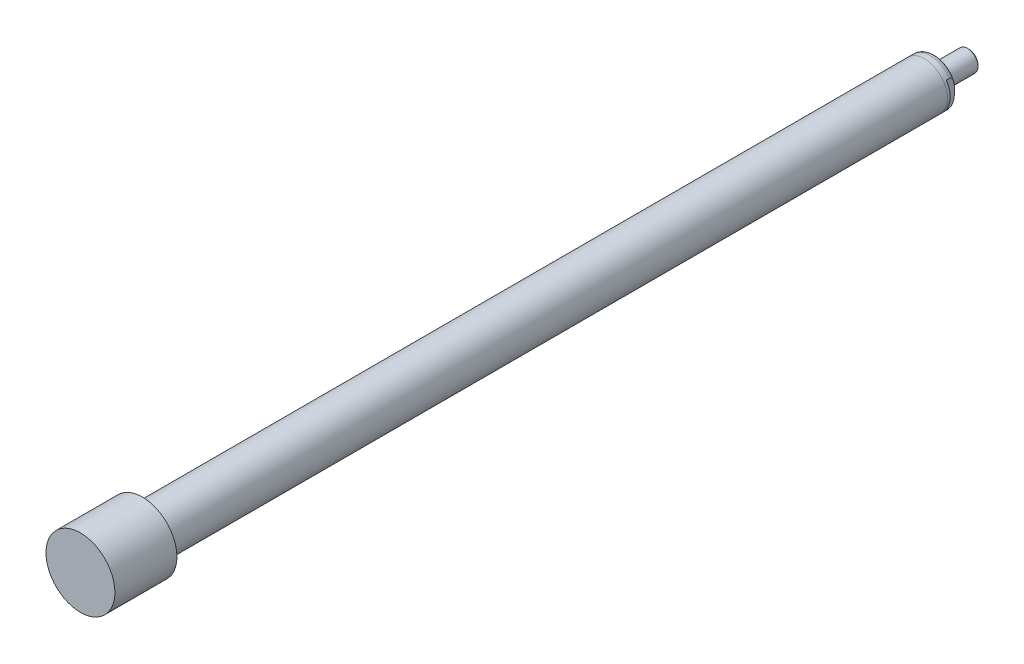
ISO-10303-21;
HEADER;
FILE_DESCRIPTION(('STEP AP214'),'2;1');
FILE_NAME('part.step','',(''),(''),'','','');
FILE_SCHEMA(('AUTOMOTIVE_DESIGN { 1 0 10303 214 1 1 1 1 }'));
ENDSEC;
DATA;
#1=APPLICATION_CONTEXT('core data for automotive mechanical design processes');
#2=APPLICATION_PROTOCOL_DEFINITION('international standard','automotive_design',2000,#1);
#3=PRODUCT_CONTEXT('',#1,'mechanical');
#4=PRODUCT('Part','Part','',(#3));
#5=PRODUCT_RELATED_PRODUCT_CATEGORY('part','',(#4));
#6=PRODUCT_DEFINITION_FORMATION('','',#4);
#7=PRODUCT_DEFINITION_CONTEXT('part definition',#1,'design');
#8=PRODUCT_DEFINITION('design','',#6,#7);
#9=PRODUCT_DEFINITION_SHAPE('','',#8);
#10=(LENGTH_UNIT() NAMED_UNIT(*) SI_UNIT(.MILLI.,.METRE.));
#11=(NAMED_UNIT(*) PLANE_ANGLE_UNIT() SI_UNIT($,.RADIAN.));
#12=(NAMED_UNIT(*) SI_UNIT($,.STERADIAN.) SOLID_ANGLE_UNIT());
#13=UNCERTAINTY_MEASURE_WITH_UNIT(LENGTH_MEASURE(1.E-05),#10,'distance_accuracy_value','');
#14=(GEOMETRIC_REPRESENTATION_CONTEXT(3) GLOBAL_UNCERTAINTY_ASSIGNED_CONTEXT((#13)) GLOBAL_UNIT_ASSIGNED_CONTEXT((#10,
#11,#12)) REPRESENTATION_CONTEXT('',''));
#15=CARTESIAN_POINT('',(0.,0.,0.));
#16=DIRECTION('',(0.,0.,1.));
#17=DIRECTION('',(1.,0.,0.));
#18=AXIS2_PLACEMENT_3D('',#15,#16,#17);
#19=CARTESIAN_POINT('',(6.985,0.,48.133));
#20=DIRECTION('',(0.,0.,1.));
#21=DIRECTION('',(1.,0.,0.));
#22=AXIS2_PLACEMENT_3D('',#19,#20,#21);
#23=PLANE('',#22);
#24=CARTESIAN_POINT('',(0.,0.,48.133));
#25=DIRECTION('',(0.,0.,1.));
#26=DIRECTION('',(0.,-1.,0.));
#27=AXIS2_PLACEMENT_3D('',#24,#25,#26);
#28=CIRCLE('',#27,19.685);
#29=CARTESIAN_POINT('',(0.,-19.685,48.133));
#30=VERTEX_POINT('',#29);
#31=EDGE_CURVE('E337',#30,#30,#28,.T.);
#32=ORIENTED_EDGE('',*,*,#31,.T.);
#33=EDGE_LOOP('',(#32));
#34=FACE_BOUND('',#33,.T.);
#35=ADVANCED_FACE('F16',(#34),#23,.T.);
#36=CARTESIAN_POINT('',(0.,0.,48.133));
#37=DIRECTION('',(0.,0.,1.));
#38=DIRECTION('',(0.,-1.,0.));
#39=AXIS2_PLACEMENT_3D('',#36,#37,#38);
#40=CYLINDRICAL_SURFACE('',#39,19.685);
#41=ORIENTED_EDGE('',*,*,#31,.F.);
#42=EDGE_LOOP('',(#41));
#43=FACE_BOUND('',#42,.T.);
#44=CARTESIAN_POINT('',(0.,0.,12.7));
#45=DIRECTION('',(0.,0.,1.));
#46=DIRECTION('',(0.,-1.,0.));
#47=AXIS2_PLACEMENT_3D('',#44,#45,#46);
#48=CIRCLE('',#47,19.685);
#49=CARTESIAN_POINT('',(0.,-19.685,12.7));
#50=VERTEX_POINT('',#49);
#51=EDGE_CURVE('E338',#50,#50,#48,.T.);
#52=ORIENTED_EDGE('',*,*,#51,.T.);
#53=EDGE_LOOP('',(#52));
#54=FACE_BOUND('',#53,.T.);
#55=ADVANCED_FACE('F268',(#43,#54),#40,.T.);
#56=CARTESIAN_POINT('',(0.,19.685,12.7));
#57=DIRECTION('',(0.,0.,1.));
#58=DIRECTION('',(0.,-1.,0.));
#59=AXIS2_PLACEMENT_3D('',#56,#57,#58);
#60=PLANE('',#59);
#61=CARTESIAN_POINT('',(0.,0.,12.7));
#62=DIRECTION('',(0.,0.,1.));
#63=DIRECTION('',(0.,-1.,0.));
#64=AXIS2_PLACEMENT_3D('',#61,#62,#63);
#65=CIRCLE('',#64,13.2);
#66=CARTESIAN_POINT('',(0.,-13.2,12.7));
#67=VERTEX_POINT('',#66);
#68=EDGE_CURVE('E83',#67,#67,#65,.F.);
#69=ORIENTED_EDGE('',*,*,#68,.F.);
#70=EDGE_LOOP('',(#69));
#71=FACE_BOUND('',#70,.T.);
#72=ORIENTED_EDGE('',*,*,#51,.F.);
#73=EDGE_LOOP('',(#72));
#74=FACE_BOUND('',#73,.T.);
#75=ADVANCED_FACE('F277',(#71,#74),#60,.F.);
#76=CARTESIAN_POINT('',(0.,0.,12.7));
#77=DIRECTION('',(0.,0.,-1.));
#78=DIRECTION('',(-1.,0.,0.));
#79=AXIS2_PLACEMENT_3D('',#76,#77,#78);
#80=CYLINDRICAL_SURFACE('',#79,13.2);
#81=ORIENTED_EDGE('',*,*,#68,.T.);
#82=EDGE_LOOP('',(#81));
#83=FACE_BOUND('',#82,.T.);
#84=CARTESIAN_POINT('',(0.,0.,-434.0352));
#85=DIRECTION('',(0.,0.,1.));
#86=DIRECTION('',(1.,0.,0.));
#87=AXIS2_PLACEMENT_3D('',#84,#85,#86);
#88=CIRCLE('',#87,13.2);
#89=CARTESIAN_POINT('',(13.2,0.,-434.0352));
#90=VERTEX_POINT('',#89);
#91=EDGE_CURVE('E20',#90,#90,#88,.T.);
#92=ORIENTED_EDGE('',*,*,#91,.T.);
#93=EDGE_LOOP('',(#92));
#94=FACE_BOUND('',#93,.T.);
#95=ADVANCED_FACE('F18',(#83,#94),#80,.T.);
#96=CARTESIAN_POINT('',(0.,0.,-434.0352));
#97=DIRECTION('',(0.,0.,1.));
#98=DIRECTION('',(1.,0.,0.));
#99=AXIS2_PLACEMENT_3D('',#96,#97,#98);
#100=PLANE('',#99);
#101=CARTESIAN_POINT('',(0.,0.,-434.0352));
#102=DIRECTION('',(0.,0.,-1.));
#103=DIRECTION('',(-1.,0.,0.));
#104=AXIS2_PLACEMENT_3D('',#101,#102,#103);
#105=CIRCLE('',#104,13.1953);
#106=CARTESIAN_POINT('',(-13.1953,0.,-434.0352));
#107=VERTEX_POINT('',#106);
#108=EDGE_CURVE('E102',#107,#107,#105,.T.);
#109=ORIENTED_EDGE('',*,*,#108,.F.);
#110=EDGE_LOOP('',(#109));
#111=FACE_BOUND('',#110,.T.);
#112=ORIENTED_EDGE('',*,*,#91,.F.);
#113=EDGE_LOOP('',(#112));
#114=FACE_BOUND('',#113,.T.);
#115=ADVANCED_FACE('F135',(#111,#114),#100,.F.);
#116=CARTESIAN_POINT('',(0.,6.,-459.4352));
#117=DIRECTION('',(0.,0.,-1.));
#118=DIRECTION('',(-1.,0.,0.));
#119=AXIS2_PLACEMENT_3D('',#116,#117,#118);
#120=PLANE('',#119);
#121=CARTESIAN_POINT('',(0.,0.,-459.4352));
#122=DIRECTION('',(0.,0.,-1.));
#123=DIRECTION('',(-1.,0.,0.));
#124=AXIS2_PLACEMENT_3D('',#121,#122,#123);
#125=CIRCLE('',#124,5.238);
#126=CARTESIAN_POINT('',(-5.238,0.,-459.4352));
#127=VERTEX_POINT('',#126);
#128=EDGE_CURVE('E105',#127,#127,#125,.T.);
#129=ORIENTED_EDGE('',*,*,#128,.T.);
#130=EDGE_LOOP('',(#129));
#131=FACE_BOUND('',#130,.T.);
#132=ADVANCED_FACE('F131',(#131),#120,.T.);
#133=CARTESIAN_POINT('',(0.,0.,-459.4352));
#134=DIRECTION('',(0.,0.,1.));
#135=DIRECTION('',(1.,0.,0.));
#136=AXIS2_PLACEMENT_3D('',#133,#134,#135);
#137=CONICAL_SURFACE('',#136,5.238,0.785398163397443);
#138=CARTESIAN_POINT('',(0.,0.,-458.6732));
#139=DIRECTION('',(0.,0.,-1.));
#140=DIRECTION('',(-1.,0.,0.));
#141=AXIS2_PLACEMENT_3D('',#138,#139,#140);
#142=CIRCLE('',#141,6.);
#143=CARTESIAN_POINT('',(-6.,0.,-458.6732));
#144=VERTEX_POINT('',#143);
#145=EDGE_CURVE('E108',#144,#144,#142,.F.);
#146=ORIENTED_EDGE('',*,*,#145,.F.);
#147=EDGE_LOOP('',(#146));
#148=FACE_BOUND('',#147,.T.);
#149=ORIENTED_EDGE('',*,*,#128,.F.);
#150=EDGE_LOOP('',(#149));
#151=FACE_BOUND('',#150,.T.);
#152=ADVANCED_FACE('F134',(#148,#151),#137,.T.);
#153=CARTESIAN_POINT('',(0.,0.,-459.4352));
#154=DIRECTION('',(0.,0.,-1.));
#155=DIRECTION('',(-1.,0.,0.));
#156=AXIS2_PLACEMENT_3D('',#153,#154,#155);
#157=CYLINDRICAL_SURFACE('',#156,6.);
#158=ORIENTED_EDGE('',*,*,#145,.T.);
#159=EDGE_LOOP('',(#158));
#160=FACE_BOUND('',#159,.T.);
#161=CARTESIAN_POINT('',(0.,0.,-443.1792));
#162=DIRECTION('',(0.,0.,-1.));
#163=DIRECTION('',(-1.,0.,0.));
#164=AXIS2_PLACEMENT_3D('',#161,#162,#163);
#165=CIRCLE('',#164,6.);
#166=CARTESIAN_POINT('',(-6.,0.,-443.1792));
#167=VERTEX_POINT('',#166);
#168=EDGE_CURVE('E77',#167,#167,#165,.T.);
#169=ORIENTED_EDGE('',*,*,#168,.T.);
#170=EDGE_LOOP('',(#169));
#171=FACE_BOUND('',#170,.T.);
#172=ADVANCED_FACE('F137',(#160,#171),#157,.T.);
#173=CARTESIAN_POINT('',(0.,4.6736,-443.1792));
#174=DIRECTION('',(0.,0.,1.));
#175=DIRECTION('',(1.,0.,0.));
#176=AXIS2_PLACEMENT_3D('',#173,#174,#175);
#177=PLANE('',#176);
#178=CARTESIAN_POINT('',(0.,0.,-443.1792));
#179=DIRECTION('',(0.,0.,-1.));
#180=DIRECTION('',(-1.,0.,0.));
#181=AXIS2_PLACEMENT_3D('',#178,#179,#180);
#182=CIRCLE('',#181,4.6736);
#183=CARTESIAN_POINT('',(-4.6736,0.,-443.1792));
#184=VERTEX_POINT('',#183);
#185=EDGE_CURVE('E90',#184,#184,#182,.T.);
#186=ORIENTED_EDGE('',*,*,#185,.T.);
#187=EDGE_LOOP('',(#186));
#188=FACE_BOUND('',#187,.T.);
#189=ORIENTED_EDGE('',*,*,#168,.F.);
#190=EDGE_LOOP('',(#189));
#191=FACE_BOUND('',#190,.T.);
#192=ADVANCED_FACE('F140',(#188,#191),#177,.T.);
#193=CARTESIAN_POINT('',(0.,0.,-459.4352));
#194=DIRECTION('',(0.,0.,-1.));
#195=DIRECTION('',(-1.,0.,0.));
#196=AXIS2_PLACEMENT_3D('',#193,#194,#195);
#197=CYLINDRICAL_SURFACE('',#196,4.6736);
#198=CARTESIAN_POINT('',(0.,0.,-440.3852));
#199=DIRECTION('',(0.,0.,-1.));
#200=DIRECTION('',(-1.,0.,0.));
#201=AXIS2_PLACEMENT_3D('',#198,#199,#200);
#202=CIRCLE('',#201,4.6736);
#203=CARTESIAN_POINT('',(-4.6736,0.,-440.3852));
#204=VERTEX_POINT('',#203);
#205=EDGE_CURVE('E93',#204,#204,#202,.T.);
#206=ORIENTED_EDGE('',*,*,#205,.T.);
#207=EDGE_LOOP('',(#206));
#208=FACE_BOUND('',#207,.T.);
#209=ORIENTED_EDGE('',*,*,#185,.F.);
#210=EDGE_LOOP('',(#209));
#211=FACE_BOUND('',#210,.T.);
#212=ADVANCED_FACE('F144',(#208,#211),#197,.T.);
#213=CARTESIAN_POINT('',(0.,10.0203,-440.3852));
#214=DIRECTION('',(0.,0.,-1.));
#215=DIRECTION('',(-1.,0.,0.));
#216=AXIS2_PLACEMENT_3D('',#213,#214,#215);
#217=PLANE('',#216);
#218=CARTESIAN_POINT('',(0.,0.,-440.3852));
#219=DIRECTION('',(0.,0.,-1.));
#220=DIRECTION('',(-1.,0.,0.));
#221=AXIS2_PLACEMENT_3D('',#218,#219,#220);
#222=CIRCLE('',#221,10.0203);
#223=CARTESIAN_POINT('',(-10.0203,0.,-440.3852));
#224=VERTEX_POINT('',#223);
#225=EDGE_CURVE('E96',#224,#224,#222,.T.);
#226=ORIENTED_EDGE('',*,*,#225,.T.);
#227=EDGE_LOOP('',(#226));
#228=FACE_BOUND('',#227,.T.);
#229=ORIENTED_EDGE('',*,*,#205,.F.);
#230=EDGE_LOOP('',(#229));
#231=FACE_BOUND('',#230,.T.);
#232=ADVANCED_FACE('F147',(#228,#231),#217,.T.);
#233=CARTESIAN_POINT('',(0.,0.,-435.6227));
#234=DIRECTION('',(0.,0.,-1.));
#235=DIRECTION('',(0.,1.,0.));
#236=AXIS2_PLACEMENT_3D('',#233,#234,#235);
#237=PLANE('',#236);
#238=CARTESIAN_POINT('',(0.,0.,-435.6227));
#239=DIRECTION('',(0.,0.,-1.));
#240=DIRECTION('',(0.,1.,0.));
#241=AXIS2_PLACEMENT_3D('',#238,#239,#240);
#242=CIRCLE('',#241,13.1953);
#243=CARTESIAN_POINT('',(11.,7.28806847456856,-435.6227));
#244=VERTEX_POINT('',#243);
#245=CARTESIAN_POINT('',(11.,-7.28806847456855,-435.6227));
#246=VERTEX_POINT('',#245);
#247=EDGE_CURVE('E60',#244,#246,#242,.T.);
#248=ORIENTED_EDGE('',*,*,#247,.T.);
#249=DIRECTION('',(0.,1.,0.));
#250=VECTOR('',#249,1.);
#251=CARTESIAN_POINT('',(11.,7.28806847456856,-435.6227));
#252=LINE('',#251,#250);
#253=EDGE_CURVE('E62',#246,#244,#252,.T.);
#254=ORIENTED_EDGE('',*,*,#253,.T.);
#255=EDGE_LOOP('',(#248,#254));
#256=FACE_BOUND('',#255,.T.);
#257=ADVANCED_FACE('F61',(#256),#237,.T.);
#258=CARTESIAN_POINT('',(0.,0.,-435.6227));
#259=DIRECTION('',(0.,0.,-1.));
#260=DIRECTION('',(0.,1.,0.));
#261=AXIS2_PLACEMENT_3D('',#258,#259,#260);
#262=PLANE('',#261);
#263=CARTESIAN_POINT('',(0.,0.,-435.6227));
#264=DIRECTION('',(0.,0.,-1.));
#265=DIRECTION('',(0.,1.,0.));
#266=AXIS2_PLACEMENT_3D('',#263,#264,#265);
#267=CIRCLE('',#266,13.1953);
#268=CARTESIAN_POINT('',(-11.,-7.28806847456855,-435.6227));
#269=VERTEX_POINT('',#268);
#270=CARTESIAN_POINT('',(-11.,7.28806847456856,-435.6227));
#271=VERTEX_POINT('',#270);
#272=EDGE_CURVE('E80',#269,#271,#267,.T.);
#273=ORIENTED_EDGE('',*,*,#272,.T.);
#274=DIRECTION('',(0.,-1.,0.));
#275=VECTOR('',#274,1.);
#276=CARTESIAN_POINT('',(-11.,7.28806847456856,-435.6227));
#277=LINE('',#276,#275);
#278=EDGE_CURVE('E82',#271,#269,#277,.T.);
#279=ORIENTED_EDGE('',*,*,#278,.T.);
#280=EDGE_LOOP('',(#273,#279));
#281=FACE_BOUND('',#280,.T.);
#282=ADVANCED_FACE('F130',(#281),#262,.T.);
#283=CARTESIAN_POINT('',(-11.,7.28806847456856,-435.6227));
#284=DIRECTION('',(1.,0.,0.));
#285=DIRECTION('',(0.,1.,0.));
#286=AXIS2_PLACEMENT_3D('',#283,#284,#285);
#287=PLANE('',#286);
#288=CARTESIAN_POINT('',(-11.,0.,-440.230268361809));
#289=CARTESIAN_POINT('',(-11.,-0.283999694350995,-440.230276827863));
#290=CARTESIAN_POINT('',(-11.,-0.568005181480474,-440.226762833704));
#291=CARTESIAN_POINT('',(-11.,-1.13588950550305,-440.212002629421));
#292=CARTESIAN_POINT('',(-11.,-1.41976830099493,-440.200754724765));
#293=CARTESIAN_POINT('',(-11.,-1.986606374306,-440.168360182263));
#294=CARTESIAN_POINT('',(-11.,-2.26956637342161,-440.147226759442));
#295=CARTESIAN_POINT('',(-11.,-2.83413520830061,-440.091455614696));
#296=CARTESIAN_POINT('',(-11.,-3.1157445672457,-440.056823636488));
#297=CARTESIAN_POINT('',(-11.,-3.55465920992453,-439.987884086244));
#298=CARTESIAN_POINT('',(-11.,-3.7129575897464,-439.959937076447));
#299=CARTESIAN_POINT('',(-11.,-4.02809043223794,-439.896800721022));
#300=CARTESIAN_POINT('',(-11.,-4.18492521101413,-439.86161297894));
#301=CARTESIAN_POINT('',(-11.,-4.49637441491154,-439.782602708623));
#302=CARTESIAN_POINT('',(-11.,-4.65098969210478,-439.738783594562));
#303=CARTESIAN_POINT('',(-11.,-4.95689533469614,-439.640873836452));
#304=CARTESIAN_POINT('',(-11.,-5.10818706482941,-439.586787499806));
#305=CARTESIAN_POINT('',(-11.,-5.45074925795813,-439.44833993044));
#306=CARTESIAN_POINT('',(-11.,-5.64036341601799,-439.359765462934));
#307=CARTESIAN_POINT('',(-11.,-6.00572300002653,-439.157289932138));
#308=CARTESIAN_POINT('',(-11.,-6.18149013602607,-439.043429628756));
#309=CARTESIAN_POINT('',(-11.,-6.4582091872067,-438.826091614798));
#310=CARTESIAN_POINT('',(-11.,-6.56534232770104,-438.730546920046));
#311=CARTESIAN_POINT('',(-11.,-6.76389982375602,-438.524235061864));
#312=CARTESIAN_POINT('',(-11.,-6.85534714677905,-438.413490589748));
#313=CARTESIAN_POINT('',(-11.,-6.9992520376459,-438.202429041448));
#314=CARTESIAN_POINT('',(-11.,-7.05586542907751,-438.10496490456));
#315=CARTESIAN_POINT('',(-11.,-7.15237368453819,-437.902019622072));
#316=CARTESIAN_POINT('',(-11.,-7.19227985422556,-437.796543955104));
#317=CARTESIAN_POINT('',(-11.,-7.25258182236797,-437.579218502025));
#318=CARTESIAN_POINT('',(-11.,-7.27283171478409,-437.467327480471));
#319=CARTESIAN_POINT('',(-11.,-7.29141605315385,-437.241741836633));
#320=CARTESIAN_POINT('',(-11.,-7.28976069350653,-437.128048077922));
#321=CARTESIAN_POINT('',(-11.,-7.26620536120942,-436.916238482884));
#322=CARTESIAN_POINT('',(-11.,-7.24667907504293,-436.817847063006));
#323=CARTESIAN_POINT('',(-11.,-7.19210149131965,-436.625513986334));
#324=CARTESIAN_POINT('',(-11.,-7.1570466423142,-436.531573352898));
#325=CARTESIAN_POINT('',(-11.,-7.06159341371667,-436.324045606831));
#326=CARTESIAN_POINT('',(-11.,-6.9968217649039,-436.212475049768));
#327=CARTESIAN_POINT('',(-11.,-6.84998946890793,-436.001353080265));
#328=CARTESIAN_POINT('',(-11.,-6.76789440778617,-435.90182622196));
#329=CARTESIAN_POINT('',(-11.,-6.55146033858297,-435.673525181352));
#330=CARTESIAN_POINT('',(-11.,-6.41012375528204,-435.551427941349));
#331=CARTESIAN_POINT('',(-11.,-6.1105685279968,-435.330585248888));
#332=CARTESIAN_POINT('',(-11.,-5.95232925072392,-435.231868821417));
#333=CARTESIAN_POINT('',(-11.,-5.64572522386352,-435.065416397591));
#334=CARTESIAN_POINT('',(-11.,-5.49859707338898,-434.995350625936));
#335=CARTESIAN_POINT('',(-11.,-5.19879419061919,-434.868116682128));
#336=CARTESIAN_POINT('',(-11.,-5.04611483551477,-434.810959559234));
#337=CARTESIAN_POINT('',(-11.,-4.73651269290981,-434.707366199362));
#338=CARTESIAN_POINT('',(-11.,-4.57957488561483,-434.660975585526));
#339=CARTESIAN_POINT('',(-11.,-4.2633801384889,-434.577457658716));
#340=CARTESIAN_POINT('',(-11.,-4.10412450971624,-434.540325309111));
#341=CARTESIAN_POINT('',(-11.,-3.80528382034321,-434.478184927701));
#342=CARTESIAN_POINT('',(-11.,-3.66589375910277,-434.452221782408));
#343=CARTESIAN_POINT('',(-11.,-3.38627572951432,-434.405241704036));
#344=CARTESIAN_POINT('',(-11.,-3.24604766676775,-434.384225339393));
#345=CARTESIAN_POINT('',(-11.,-2.82435930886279,-434.327438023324));
#346=CARTESIAN_POINT('',(-11.,-2.54205294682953,-434.297959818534));
#347=CARTESIAN_POINT('',(-11.,-1.97560851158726,-434.251021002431));
#348=CARTESIAN_POINT('',(-11.,-1.69146746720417,-434.233599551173));
#349=CARTESIAN_POINT('',(-11.,-1.12288122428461,-434.207792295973));
#350=CARTESIAN_POINT('',(-11.,-0.838436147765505,-434.199403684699));
#351=CARTESIAN_POINT('',(-11.,-0.268305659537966,-434.189955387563));
#352=CARTESIAN_POINT('',(-11.,0.0173801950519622,-434.188924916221));
#353=CARTESIAN_POINT('',(-11.,0.588744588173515,-434.194052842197));
#354=CARTESIAN_POINT('',(-11.,0.874423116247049,-434.200212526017));
#355=CARTESIAN_POINT('',(-11.,1.44479398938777,-434.220965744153));
#356=CARTESIAN_POINT('',(-11.,1.72948704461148,-434.235538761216));
#357=CARTESIAN_POINT('',(-11.,2.29804894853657,-434.275819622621));
#358=CARTESIAN_POINT('',(-11.,2.58191804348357,-434.301523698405));
#359=CARTESIAN_POINT('',(-11.,3.06947658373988,-434.359089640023));
#360=CARTESIAN_POINT('',(-11.,3.27359191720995,-434.387272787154));
#361=CARTESIAN_POINT('',(-11.,3.68030619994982,-434.453886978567));
#362=CARTESIAN_POINT('',(-11.,3.88290424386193,-434.492323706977));
#363=CARTESIAN_POINT('',(-11.,4.28378522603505,-434.581764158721));
#364=CARTESIAN_POINT('',(-11.,4.48208907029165,-434.632672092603));
#365=CARTESIAN_POINT('',(-11.,4.87385387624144,-434.75034497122));
#366=CARTESIAN_POINT('',(-11.,5.06731944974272,-434.817094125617));
#367=CARTESIAN_POINT('',(-11.,5.42309726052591,-434.960885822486));
#368=CARTESIAN_POINT('',(-11.,5.58631452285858,-435.035652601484));
#369=CARTESIAN_POINT('',(-11.,5.90375766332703,-435.203613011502));
#370=CARTESIAN_POINT('',(-11.,6.05795849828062,-435.296855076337));
#371=CARTESIAN_POINT('',(-11.,6.3534724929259,-435.506180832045));
#372=CARTESIAN_POINT('',(-11.,6.49458439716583,-435.622554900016));
#373=CARTESIAN_POINT('',(-11.,6.75236292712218,-435.87972070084));
#374=CARTESIAN_POINT('',(-11.,6.86913495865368,-436.020402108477));
#375=CARTESIAN_POINT('',(-11.,7.02685937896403,-436.264523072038));
#376=CARTESIAN_POINT('',(-11.,7.0794757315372,-436.360434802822));
#377=CARTESIAN_POINT('',(-11.,7.16853265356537,-436.559564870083));
#378=CARTESIAN_POINT('',(-11.,7.20498337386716,-436.662778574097));
#379=CARTESIAN_POINT('',(-11.,7.2592011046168,-436.874792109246));
#380=CARTESIAN_POINT('',(-11.,7.27684597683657,-436.983623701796));
#381=CARTESIAN_POINT('',(-11.,7.29147337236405,-437.202665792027));
#382=CARTESIAN_POINT('',(-11.,7.28846304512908,-437.312875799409));
#383=CARTESIAN_POINT('',(-11.,7.26329711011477,-437.520810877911));
#384=CARTESIAN_POINT('',(-11.,7.24291275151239,-437.61875784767));
#385=CARTESIAN_POINT('',(-11.,7.1867978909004,-437.810114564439));
#386=CARTESIAN_POINT('',(-11.,7.15106215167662,-437.903522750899));
#387=CARTESIAN_POINT('',(-11.,7.05375831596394,-438.11087759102));
#388=CARTESIAN_POINT('',(-11.,6.987672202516,-438.222699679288));
#389=CARTESIAN_POINT('',(-11.,6.83821910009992,-438.434096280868));
#390=CARTESIAN_POINT('',(-11.,6.75482099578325,-438.53364822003));
#391=CARTESIAN_POINT('',(-11.,6.53478721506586,-438.76232461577));
#392=CARTESIAN_POINT('',(-11.,6.39108122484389,-438.884601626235));
#393=CARTESIAN_POINT('',(-11.,6.08671299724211,-439.105560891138));
#394=CARTESIAN_POINT('',(-11.,5.92601813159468,-439.20419650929));
#395=CARTESIAN_POINT('',(-11.,5.61399295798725,-439.370750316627));
#396=CARTESIAN_POINT('',(-11.,5.46384379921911,-439.440932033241));
#397=CARTESIAN_POINT('',(-11.,5.15800379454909,-439.568138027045));
#398=CARTESIAN_POINT('',(-11.,5.00230841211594,-439.625151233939));
#399=CARTESIAN_POINT('',(-11.,4.68703415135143,-439.728164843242));
#400=CARTESIAN_POINT('',(-11.,4.52744819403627,-439.774143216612));
#401=CARTESIAN_POINT('',(-11.,4.20585528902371,-439.856793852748));
#402=CARTESIAN_POINT('',(-11.,4.04384743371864,-439.893462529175));
#403=CARTESIAN_POINT('',(-11.,3.72194157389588,-439.958303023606));
#404=CARTESIAN_POINT('',(-11.,3.5620776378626,-439.986646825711));
#405=CARTESIAN_POINT('',(-11.,3.2414136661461,-440.037154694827));
#406=CARTESIAN_POINT('',(-11.,3.08061376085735,-440.059319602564));
#407=CARTESIAN_POINT('',(-11.,2.75826796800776,-440.098536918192));
#408=CARTESIAN_POINT('',(-11.,2.59672157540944,-440.115585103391));
#409=CARTESIAN_POINT('',(-11.,2.27322894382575,-440.145415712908));
#410=CARTESIAN_POINT('',(-11.,2.11128267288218,-440.158197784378));
#411=CARTESIAN_POINT('',(-11.,1.78700791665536,-440.180207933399));
#412=CARTESIAN_POINT('',(-11.,1.62467921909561,-440.18943282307));
#413=CARTESIAN_POINT('',(-11.,1.29988702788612,-440.204857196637));
#414=CARTESIAN_POINT('',(-11.,1.13742353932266,-440.211056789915));
#415=CARTESIAN_POINT('',(-11.,0.81248344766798,-440.220819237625));
#416=CARTESIAN_POINT('',(-11.,0.650006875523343,-440.224383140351));
#417=CARTESIAN_POINT('',(-11.,0.325020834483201,-440.229105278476));
#418=CARTESIAN_POINT('',(-11.,0.162511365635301,-440.230263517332));
#419=CARTESIAN_POINT('',(-11.,0.,-440.230268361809));
#420=B_SPLINE_CURVE_WITH_KNOTS('',3,(#288,#289,#290,#291,#292,#293,#294,#295,#296,#297,#298,
#299,#300,#301,#302,#303,#304,#305,#306,#307,#308,#309,#310,#311,#312,#313,#314,#315,#316,#317,
#318,#319,#320,#321,#322,#323,#324,#325,#326,#327,#328,#329,#330,#331,#332,#333,#334,#335,#336,
#337,#338,#339,#340,#341,#342,#343,#344,#345,#346,#347,#348,#349,#350,#351,#352,#353,#354,#355,
#356,#357,#358,#359,#360,#361,#362,#363,#364,#365,#366,#367,#368,#369,#370,#371,#372,#373,#374,
#375,#376,#377,#378,#379,#380,#381,#382,#383,#384,#385,#386,#387,#388,#389,#390,#391,#392,#393,
#394,#395,#396,#397,#398,#399,#400,#401,#402,#403,#404,#405,#406,#407,#408,#409,#410,#411,#412,
#413,#414,#415,#416,#417,#418,#419),.UNSPECIFIED.,.T.,.F.,(4,2,2,2,2,2,2,2,2,2,2,2,2,2,2,2,2,2,
2,2,2,2,2,2,2,2,2,2,2,2,2,2,2,2,2,2,2,2,2,2,2,2,2,2,2,2,2,2,2,2,2,2,2,2,2,2,2,2,2,2,2,2,2,2,2,
4),(0.,0.851985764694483,1.70415826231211,2.55519481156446,3.40586963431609,3.887975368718,
4.36997444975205,4.85178325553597,5.33339037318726,5.9597982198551,6.58520355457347,
7.01456982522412,7.44330194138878,7.78013770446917,8.11674516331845,8.45583253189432,
8.79476209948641,9.09432594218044,9.39395833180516,9.77885740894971,10.1645284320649,
10.7217137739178,11.2795872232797,11.7677560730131,12.256341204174,12.7469603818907,
13.2373120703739,13.6625744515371,14.0878856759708,14.9389905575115,15.7928469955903,
16.6464379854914,17.5034161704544,18.3605477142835,19.215597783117,20.0703585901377,
20.688318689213,21.3066220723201,21.9203175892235,22.5334039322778,23.0710845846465,
23.6101938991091,24.156554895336,24.7004982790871,25.0274756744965,25.3542474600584,
25.6831288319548,26.0118963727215,26.3106776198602,26.6095608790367,26.9970844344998,
27.3853106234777,27.9482115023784,28.5122138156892,29.008712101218,29.5056262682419,
30.0035243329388,30.5016139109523,30.9885424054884,31.4754046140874,31.9626675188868,
32.4499707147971,32.9377096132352,33.4254308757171,33.9129580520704,34.4004845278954),.UNSPECIFIED.);
#421=CARTESIAN_POINT('',(-11.,7.28806847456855,-437.2102));
#422=VERTEX_POINT('',#421);
#423=CARTESIAN_POINT('',(-11.,-7.28806847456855,-437.210200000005));
#424=VERTEX_POINT('',#423);
#425=EDGE_CURVE('E25',#422,#424,#420,.T.);
#426=ORIENTED_EDGE('',*,*,#425,.T.);
#427=DIRECTION('',(0.,0.,-1.));
#428=VECTOR('',#427,1.);
#429=CARTESIAN_POINT('',(-11.,-7.28806847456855,-435.6227));
#430=LINE('',#429,#428);
#431=EDGE_CURVE('E65',#269,#424,#430,.T.);
#432=ORIENTED_EDGE('',*,*,#431,.F.);
#433=ORIENTED_EDGE('',*,*,#278,.F.);
#434=DIRECTION('',(0.,0.,-1.));
#435=VECTOR('',#434,1.);
#436=CARTESIAN_POINT('',(-11.,7.28806847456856,-435.6227));
#437=LINE('',#436,#435);
#438=EDGE_CURVE('E40',#271,#422,#437,.T.);
#439=ORIENTED_EDGE('',*,*,#438,.T.);
#440=EDGE_LOOP('',(#426,#432,#433,#439));
#441=FACE_BOUND('',#440,.T.);
#442=ADVANCED_FACE('F125',(#441),#287,.F.);
#443=CARTESIAN_POINT('',(0.,0.,-437.2102));
#444=DIRECTION('',(0.,0.,-1.));
#445=DIRECTION('',(-1.,0.,0.));
#446=AXIS2_PLACEMENT_3D('',#443,#444,#445);
#447=TOROIDAL_SURFACE('',#446,10.0203,3.175);
#448=CARTESIAN_POINT('',(11.,0.,-440.230268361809));
#449=CARTESIAN_POINT('',(11.,0.283999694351,-440.230276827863));
#450=CARTESIAN_POINT('',(11.,0.568005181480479,-440.226762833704));
#451=CARTESIAN_POINT('',(11.,1.13588950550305,-440.212002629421));
#452=CARTESIAN_POINT('',(11.,1.41976830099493,-440.200754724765));
#453=CARTESIAN_POINT('',(11.,1.98660637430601,-440.168360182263));
#454=CARTESIAN_POINT('',(11.,2.26956637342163,-440.147226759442));
#455=CARTESIAN_POINT('',(11.,2.83413520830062,-440.091455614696));
#456=CARTESIAN_POINT('',(11.,3.11574456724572,-440.056823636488));
#457=CARTESIAN_POINT('',(11.,3.55465920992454,-439.987884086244));
#458=CARTESIAN_POINT('',(11.,3.71295758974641,-439.959937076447));
#459=CARTESIAN_POINT('',(11.,4.02809043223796,-439.896800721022));
#460=CARTESIAN_POINT('',(11.,4.18492521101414,-439.86161297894));
#461=CARTESIAN_POINT('',(11.,4.49637441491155,-439.782602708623));
#462=CARTESIAN_POINT('',(11.,4.65098969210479,-439.738783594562));
#463=CARTESIAN_POINT('',(11.,4.95689533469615,-439.640873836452));
#464=CARTESIAN_POINT('',(11.,5.10818706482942,-439.586787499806));
#465=CARTESIAN_POINT('',(11.,5.45074925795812,-439.44833993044));
#466=CARTESIAN_POINT('',(11.,5.64036341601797,-439.359765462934));
#467=CARTESIAN_POINT('',(11.,6.00572300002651,-439.157289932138));
#468=CARTESIAN_POINT('',(11.,6.18149013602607,-439.043429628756));
#469=CARTESIAN_POINT('',(11.,6.45820918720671,-438.826091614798));
#470=CARTESIAN_POINT('',(11.,6.56534232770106,-438.730546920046));
#471=CARTESIAN_POINT('',(11.,6.76389982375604,-438.524235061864));
#472=CARTESIAN_POINT('',(11.,6.85534714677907,-438.413490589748));
#473=CARTESIAN_POINT('',(11.,6.99925203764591,-438.202429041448));
#474=CARTESIAN_POINT('',(11.,7.05586542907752,-438.10496490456));
#475=CARTESIAN_POINT('',(11.,7.15237368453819,-437.902019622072));
#476=CARTESIAN_POINT('',(11.,7.19227985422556,-437.796543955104));
#477=CARTESIAN_POINT('',(11.,7.25258182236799,-437.579218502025));
#478=CARTESIAN_POINT('',(11.,7.27283171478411,-437.467327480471));
#479=CARTESIAN_POINT('',(11.,7.29141605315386,-437.241741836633));
#480=CARTESIAN_POINT('',(11.,7.28976069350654,-437.128048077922));
#481=CARTESIAN_POINT('',(11.,7.26620536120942,-436.916238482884));
#482=CARTESIAN_POINT('',(11.,7.24667907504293,-436.817847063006));
#483=CARTESIAN_POINT('',(11.,7.19210149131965,-436.625513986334));
#484=CARTESIAN_POINT('',(11.,7.15704664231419,-436.531573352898));
#485=CARTESIAN_POINT('',(11.,7.06159341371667,-436.324045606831));
#486=CARTESIAN_POINT('',(11.,6.9968217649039,-436.212475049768));
#487=CARTESIAN_POINT('',(11.,6.84998946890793,-436.001353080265));
#488=CARTESIAN_POINT('',(11.,6.76789440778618,-435.90182622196));
#489=CARTESIAN_POINT('',(11.,6.55146033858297,-435.673525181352));
#490=CARTESIAN_POINT('',(11.,6.41012375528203,-435.551427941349));
#491=CARTESIAN_POINT('',(11.,6.11056852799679,-435.330585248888));
#492=CARTESIAN_POINT('',(11.,5.95232925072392,-435.231868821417));
#493=CARTESIAN_POINT('',(11.,5.64572522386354,-435.065416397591));
#494=CARTESIAN_POINT('',(11.,5.49859707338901,-434.995350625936));
#495=CARTESIAN_POINT('',(11.,5.19879419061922,-434.868116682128));
#496=CARTESIAN_POINT('',(11.,5.04611483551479,-434.810959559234));
#497=CARTESIAN_POINT('',(11.,4.73651269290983,-434.707366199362));
#498=CARTESIAN_POINT('',(11.,4.57957488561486,-434.660975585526));
#499=CARTESIAN_POINT('',(11.,4.26338013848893,-434.577457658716));
#500=CARTESIAN_POINT('',(11.,4.10412450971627,-434.540325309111));
#501=CARTESIAN_POINT('',(11.,3.80528382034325,-434.478184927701));
#502=CARTESIAN_POINT('',(11.,3.66589375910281,-434.452221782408));
#503=CARTESIAN_POINT('',(11.,3.38627572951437,-434.405241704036));
#504=CARTESIAN_POINT('',(11.,3.24604766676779,-434.384225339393));
#505=CARTESIAN_POINT('',(11.,2.82435930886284,-434.327438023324));
#506=CARTESIAN_POINT('',(11.,2.54205294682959,-434.297959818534));
#507=CARTESIAN_POINT('',(11.,1.97560851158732,-434.251021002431));
#508=CARTESIAN_POINT('',(11.,1.69146746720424,-434.233599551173));
#509=CARTESIAN_POINT('',(11.,1.12288122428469,-434.207792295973));
#510=CARTESIAN_POINT('',(11.,0.838436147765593,-434.199403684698));
#511=CARTESIAN_POINT('',(11.,0.268305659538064,-434.189955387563));
#512=CARTESIAN_POINT('',(11.,-0.0173801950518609,-434.188924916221));
#513=CARTESIAN_POINT('',(11.,-0.588744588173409,-434.194052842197));
#514=CARTESIAN_POINT('',(11.,-0.874423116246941,-434.200212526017));
#515=CARTESIAN_POINT('',(11.,-1.44479398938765,-434.220965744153));
#516=CARTESIAN_POINT('',(11.,-1.72948704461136,-434.235538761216));
#517=CARTESIAN_POINT('',(11.,-2.29804894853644,-434.275819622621));
#518=CARTESIAN_POINT('',(11.,-2.58191804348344,-434.301523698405));
#519=CARTESIAN_POINT('',(11.,-3.06947658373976,-434.359089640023));
#520=CARTESIAN_POINT('',(11.,-3.27359191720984,-434.387272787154));
#521=CARTESIAN_POINT('',(11.,-3.68030619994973,-434.453886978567));
#522=CARTESIAN_POINT('',(11.,-3.88290424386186,-434.492323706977));
#523=CARTESIAN_POINT('',(11.,-4.28378522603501,-434.581764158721));
#524=CARTESIAN_POINT('',(11.,-4.48208907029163,-434.632672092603));
#525=CARTESIAN_POINT('',(11.,-4.87385387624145,-434.75034497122));
#526=CARTESIAN_POINT('',(11.,-5.06731944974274,-434.817094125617));
#527=CARTESIAN_POINT('',(11.,-5.42309726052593,-434.960885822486));
#528=CARTESIAN_POINT('',(11.,-5.5863145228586,-435.035652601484));
#529=CARTESIAN_POINT('',(11.,-5.90375766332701,-435.203613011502));
#530=CARTESIAN_POINT('',(11.,-6.05795849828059,-435.296855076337));
#531=CARTESIAN_POINT('',(11.,-6.35347249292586,-435.506180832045));
#532=CARTESIAN_POINT('',(11.,-6.49458439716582,-435.622554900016));
#533=CARTESIAN_POINT('',(11.,-6.75236292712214,-435.87972070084));
#534=CARTESIAN_POINT('',(11.,-6.86913495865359,-436.020402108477));
#535=CARTESIAN_POINT('',(11.,-7.02685937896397,-436.264523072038));
#536=CARTESIAN_POINT('',(11.,-7.07947573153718,-436.360434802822));
#537=CARTESIAN_POINT('',(11.,-7.16853265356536,-436.559564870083));
#538=CARTESIAN_POINT('',(11.,-7.20498337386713,-436.662778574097));
#539=CARTESIAN_POINT('',(11.,-7.25920110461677,-436.874792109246));
#540=CARTESIAN_POINT('',(11.,-7.27684597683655,-436.983623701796));
#541=CARTESIAN_POINT('',(11.,-7.29147337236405,-437.202665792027));
#542=CARTESIAN_POINT('',(11.,-7.28846304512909,-437.312875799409));
#543=CARTESIAN_POINT('',(11.,-7.26329711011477,-437.520810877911));
#544=CARTESIAN_POINT('',(11.,-7.24291275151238,-437.61875784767));
#545=CARTESIAN_POINT('',(11.,-7.1867978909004,-437.810114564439));
#546=CARTESIAN_POINT('',(11.,-7.15106215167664,-437.903522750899));
#547=CARTESIAN_POINT('',(11.,-7.05375831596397,-438.11087759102));
#548=CARTESIAN_POINT('',(11.,-6.987672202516,-438.222699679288));
#549=CARTESIAN_POINT('',(11.,-6.83821910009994,-438.434096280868));
#550=CARTESIAN_POINT('',(11.,-6.7548209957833,-438.53364822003));
#551=CARTESIAN_POINT('',(11.,-6.53478721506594,-438.76232461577));
#552=CARTESIAN_POINT('',(11.,-6.39108122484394,-438.884601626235));
#553=CARTESIAN_POINT('',(11.,-6.08671299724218,-439.105560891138));
#554=CARTESIAN_POINT('',(11.,-5.92601813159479,-439.20419650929));
#555=CARTESIAN_POINT('',(11.,-5.61399295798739,-439.370750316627));
#556=CARTESIAN_POINT('',(11.,-5.46384379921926,-439.440932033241));
#557=CARTESIAN_POINT('',(11.,-5.15800379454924,-439.568138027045));
#558=CARTESIAN_POINT('',(11.,-5.0023084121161,-439.625151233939));
#559=CARTESIAN_POINT('',(11.,-4.68703415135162,-439.728164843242));
#560=CARTESIAN_POINT('',(11.,-4.52744819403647,-439.774143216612));
#561=CARTESIAN_POINT('',(11.,-4.20585528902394,-439.856793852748));
#562=CARTESIAN_POINT('',(11.,-4.04384743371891,-439.893462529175));
#563=CARTESIAN_POINT('',(11.,-3.72194157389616,-439.958303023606));
#564=CARTESIAN_POINT('',(11.,-3.56207763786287,-439.986646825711));
#565=CARTESIAN_POINT('',(11.,-3.24141366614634,-440.037154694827));
#566=CARTESIAN_POINT('',(11.,-3.08061376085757,-440.059319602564));
#567=CARTESIAN_POINT('',(11.,-2.75826796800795,-440.098536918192));
#568=CARTESIAN_POINT('',(11.,-2.59672157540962,-440.115585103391));
#569=CARTESIAN_POINT('',(11.,-2.27322894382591,-440.145415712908));
#570=CARTESIAN_POINT('',(11.,-2.11128267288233,-440.158197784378));
#571=CARTESIAN_POINT('',(11.,-1.78700791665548,-440.180207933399));
#572=CARTESIAN_POINT('',(11.,-1.62467921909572,-440.18943282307));
#573=CARTESIAN_POINT('',(11.,-1.29988702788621,-440.204857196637));
#574=CARTESIAN_POINT('',(11.,-1.13742353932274,-440.211056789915));
#575=CARTESIAN_POINT('',(11.,-0.812483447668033,-440.220819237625));
#576=CARTESIAN_POINT('',(11.,-0.650006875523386,-440.224383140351));
#577=CARTESIAN_POINT('',(11.,-0.325020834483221,-440.229105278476));
#578=CARTESIAN_POINT('',(11.,-0.162511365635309,-440.230263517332));
#579=CARTESIAN_POINT('',(11.,0.,-440.230268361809));
#580=B_SPLINE_CURVE_WITH_KNOTS('',3,(#448,#449,#450,#451,#452,#453,#454,#455,#456,#457,#458,
#459,#460,#461,#462,#463,#464,#465,#466,#467,#468,#469,#470,#471,#472,#473,#474,#475,#476,#477,
#478,#479,#480,#481,#482,#483,#484,#485,#486,#487,#488,#489,#490,#491,#492,#493,#494,#495,#496,
#497,#498,#499,#500,#501,#502,#503,#504,#505,#506,#507,#508,#509,#510,#511,#512,#513,#514,#515,
#516,#517,#518,#519,#520,#521,#522,#523,#524,#525,#526,#527,#528,#529,#530,#531,#532,#533,#534,
#535,#536,#537,#538,#539,#540,#541,#542,#543,#544,#545,#546,#547,#548,#549,#550,#551,#552,#553,
#554,#555,#556,#557,#558,#559,#560,#561,#562,#563,#564,#565,#566,#567,#568,#569,#570,#571,#572,
#573,#574,#575,#576,#577,#578,#579),.UNSPECIFIED.,.T.,.F.,(4,2,2,2,2,2,2,2,2,2,2,2,2,2,2,2,2,2,
2,2,2,2,2,2,2,2,2,2,2,2,2,2,2,2,2,2,2,2,2,2,2,2,2,2,2,2,2,2,2,2,2,2,2,2,2,2,2,2,2,2,2,2,2,2,2,
4),(0.,0.851985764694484,1.70415826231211,2.55519481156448,3.40586963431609,3.88797536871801,
4.36997444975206,4.85178325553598,5.33339037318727,5.95979821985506,6.58520355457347,
7.01456982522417,7.44330194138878,7.78013770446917,8.11674516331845,8.45583253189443,
8.79476209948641,9.09432594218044,9.39395833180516,9.77885740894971,10.1645284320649,
10.7217137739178,11.2795872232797,11.7677560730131,12.256341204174,12.7469603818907,
13.2373120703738,13.662574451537,14.0878856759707,14.9389905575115,15.7928469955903,
16.6464379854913,17.5034161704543,18.3605477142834,19.2155977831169,20.0703585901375,
20.6883186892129,21.3066220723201,21.9203175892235,22.5334039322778,23.0710845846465,
23.6101938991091,24.156554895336,24.700498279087,25.0274756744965,25.3542474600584,
25.6831288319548,26.0118963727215,26.3106776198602,26.6095608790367,26.9970844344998,
27.3853106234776,27.9482115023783,28.5122138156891,29.0087121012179,29.5056262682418,
30.0035243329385,30.501613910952,30.9885424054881,31.4754046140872,31.9626675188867,
32.449970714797,32.9377096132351,33.425430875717,33.9129580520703,34.4004845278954),.UNSPECIFIED.);
#581=CARTESIAN_POINT('',(11.,-7.28806847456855,-437.2102));
#582=VERTEX_POINT('',#581);
#583=CARTESIAN_POINT('',(11.,7.28806847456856,-437.210200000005));
#584=VERTEX_POINT('',#583);
#585=EDGE_CURVE('E10',#582,#584,#580,.T.);
#586=ORIENTED_EDGE('',*,*,#585,.F.);
#587=CARTESIAN_POINT('',(0.,0.,-437.2102));
#588=DIRECTION('',(0.,0.,-1.));
#589=DIRECTION('',(-1.,0.,0.));
#590=AXIS2_PLACEMENT_3D('',#587,#588,#589);
#591=CIRCLE('',#590,13.1953);
#592=EDGE_CURVE('E75',#582,#424,#591,.T.);
#593=ORIENTED_EDGE('',*,*,#592,.T.);
#594=ORIENTED_EDGE('',*,*,#425,.F.);
#595=EDGE_CURVE('E99',#422,#584,#591,.T.);
#596=ORIENTED_EDGE('',*,*,#595,.T.);
#597=EDGE_LOOP('',(#586,#593,#594,#596));
#598=FACE_BOUND('',#597,.T.);
#599=ORIENTED_EDGE('',*,*,#225,.F.);
#600=EDGE_LOOP('',(#599));
#601=FACE_BOUND('',#600,.T.);
#602=ADVANCED_FACE('F121',(#598,#601),#447,.T.);
#603=CARTESIAN_POINT('',(11.,7.28806847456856,-435.6227));
#604=DIRECTION('',(-1.,0.,0.));
#605=DIRECTION('',(0.,-1.,0.));
#606=AXIS2_PLACEMENT_3D('',#603,#604,#605);
#607=PLANE('',#606);
#608=ORIENTED_EDGE('',*,*,#585,.T.);
#609=DIRECTION('',(0.,0.,-1.));
#610=VECTOR('',#609,1.);
#611=CARTESIAN_POINT('',(11.,7.28806847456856,-435.6227));
#612=LINE('',#611,#610);
#613=EDGE_CURVE('E68',#244,#584,#612,.T.);
#614=ORIENTED_EDGE('',*,*,#613,.F.);
#615=ORIENTED_EDGE('',*,*,#253,.F.);
#616=DIRECTION('',(0.,0.,-1.));
#617=VECTOR('',#616,1.);
#618=CARTESIAN_POINT('',(11.,-7.28806847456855,-435.6227));
#619=LINE('',#618,#617);
#620=EDGE_CURVE('E32',#246,#582,#619,.T.);
#621=ORIENTED_EDGE('',*,*,#620,.T.);
#622=EDGE_LOOP('',(#608,#614,#615,#621));
#623=FACE_BOUND('',#622,.T.);
#624=ADVANCED_FACE('F67',(#623),#607,.F.);
#625=CARTESIAN_POINT('',(0.,0.,-459.4352));
#626=DIRECTION('',(0.,0.,-1.));
#627=DIRECTION('',(-1.,0.,0.));
#628=AXIS2_PLACEMENT_3D('',#625,#626,#627);
#629=CYLINDRICAL_SURFACE('',#628,13.1953);
#630=ORIENTED_EDGE('',*,*,#613,.T.);
#631=ORIENTED_EDGE('',*,*,#595,.F.);
#632=ORIENTED_EDGE('',*,*,#438,.F.);
#633=ORIENTED_EDGE('',*,*,#272,.F.);
#634=ORIENTED_EDGE('',*,*,#431,.T.);
#635=ORIENTED_EDGE('',*,*,#592,.F.);
#636=ORIENTED_EDGE('',*,*,#620,.F.);
#637=ORIENTED_EDGE('',*,*,#247,.F.);
#638=EDGE_LOOP('',(#630,#631,#632,#633,#634,#635,#636,#637));
#639=FACE_BOUND('',#638,.T.);
#640=ORIENTED_EDGE('',*,*,#108,.T.);
#641=EDGE_LOOP('',(#640));
#642=FACE_BOUND('',#641,.T.);
#643=ADVANCED_FACE('F71',(#639,#642),#629,.T.);
#644=CLOSED_SHELL('',(#35,#55,#75,#95,#115,#132,#152,#172,#192,#212,#232,#257,#282,#442,#602,
#624,#643));
#645=MANIFOLD_SOLID_BREP('B1',#644);
#646=ADVANCED_BREP_SHAPE_REPRESENTATION('',(#18,#645),#14);
#647=SHAPE_DEFINITION_REPRESENTATION(#9,#646);
ENDSEC;
END-ISO-10303-21;
